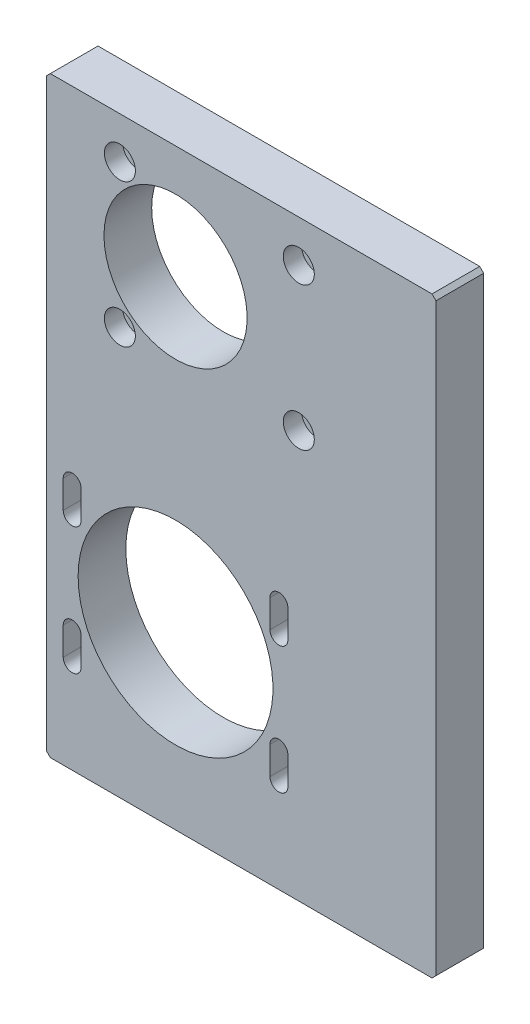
ISO-10303-21;
HEADER;
FILE_DESCRIPTION(('STEP AP214'),'2;1');
FILE_NAME('part.step','',(''),(''),'','','');
FILE_SCHEMA(('AUTOMOTIVE_DESIGN { 1 0 10303 214 1 1 1 1 }'));
ENDSEC;
DATA;
#1=APPLICATION_CONTEXT('core data for automotive mechanical design processes');
#2=APPLICATION_PROTOCOL_DEFINITION('international standard','automotive_design',2000,#1);
#3=PRODUCT_CONTEXT('',#1,'mechanical');
#4=PRODUCT('Part','Part','',(#3));
#5=PRODUCT_RELATED_PRODUCT_CATEGORY('part','',(#4));
#6=PRODUCT_DEFINITION_FORMATION('','',#4);
#7=PRODUCT_DEFINITION_CONTEXT('part definition',#1,'design');
#8=PRODUCT_DEFINITION('design','',#6,#7);
#9=PRODUCT_DEFINITION_SHAPE('','',#8);
#10=(LENGTH_UNIT() NAMED_UNIT(*) SI_UNIT(.MILLI.,.METRE.));
#11=(NAMED_UNIT(*) PLANE_ANGLE_UNIT() SI_UNIT($,.RADIAN.));
#12=(NAMED_UNIT(*) SI_UNIT($,.STERADIAN.) SOLID_ANGLE_UNIT());
#13=UNCERTAINTY_MEASURE_WITH_UNIT(LENGTH_MEASURE(1.E-05),#10,'distance_accuracy_value','');
#14=(GEOMETRIC_REPRESENTATION_CONTEXT(3) GLOBAL_UNCERTAINTY_ASSIGNED_CONTEXT((#13)) GLOBAL_UNIT_ASSIGNED_CONTEXT((#10,
#11,#12)) REPRESENTATION_CONTEXT('',''));
#15=CARTESIAN_POINT('',(0.,0.,0.));
#16=DIRECTION('',(0.,0.,1.));
#17=DIRECTION('',(1.,0.,0.));
#18=AXIS2_PLACEMENT_3D('',#15,#16,#17);
#19=CARTESIAN_POINT('',(13299.82505141,2105.954083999,0.));
#20=DIRECTION('',(0.,0.,1.));
#21=DIRECTION('',(1.,0.,0.));
#22=AXIS2_PLACEMENT_3D('',#19,#20,#21);
#23=CYLINDRICAL_SURFACE('',#22,2.25000000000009);
#24=CARTESIAN_POINT('',(13299.82505141,2105.954083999,0.));
#25=DIRECTION('',(0.,0.,1.));
#26=DIRECTION('',(1.,0.,0.));
#27=AXIS2_PLACEMENT_3D('',#24,#25,#26);
#28=CIRCLE('',#27,2.25000000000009);
#29=CARTESIAN_POINT('',(13302.07505141,2105.954083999,0.));
#30=VERTEX_POINT('',#29);
#31=EDGE_CURVE('E314',#30,#30,#28,.F.);
#32=ORIENTED_EDGE('',*,*,#31,.T.);
#33=EDGE_LOOP('',(#32));
#34=FACE_BOUND('',#33,.T.);
#35=CARTESIAN_POINT('',(13299.82505141,2105.954083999,7.4));
#36=DIRECTION('',(0.,0.,1.));
#37=DIRECTION('',(1.,0.,0.));
#38=AXIS2_PLACEMENT_3D('',#35,#36,#37);
#39=CIRCLE('',#38,2.25000000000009);
#40=CARTESIAN_POINT('',(13302.07505141,2105.954083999,7.4));
#41=VERTEX_POINT('',#40);
#42=EDGE_CURVE('E21',#41,#41,#39,.T.);
#43=ORIENTED_EDGE('',*,*,#42,.T.);
#44=EDGE_LOOP('',(#43));
#45=FACE_BOUND('',#44,.T.);
#46=ADVANCED_FACE('F17',(#34,#45),#23,.F.);
#47=CARTESIAN_POINT('',(13254.82505141,2105.954083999,0.));
#48=DIRECTION('',(0.,0.,1.));
#49=DIRECTION('',(1.,0.,0.));
#50=AXIS2_PLACEMENT_3D('',#47,#48,#49);
#51=CYLINDRICAL_SURFACE('',#50,2.25000000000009);
#52=CARTESIAN_POINT('',(13254.82505141,2105.954083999,0.));
#53=DIRECTION('',(0.,0.,1.));
#54=DIRECTION('',(1.,0.,0.));
#55=AXIS2_PLACEMENT_3D('',#52,#53,#54);
#56=CIRCLE('',#55,2.25000000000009);
#57=CARTESIAN_POINT('',(13257.07505141,2105.954083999,0.));
#58=VERTEX_POINT('',#57);
#59=EDGE_CURVE('E311',#58,#58,#56,.F.);
#60=ORIENTED_EDGE('',*,*,#59,.T.);
#61=EDGE_LOOP('',(#60));
#62=FACE_BOUND('',#61,.T.);
#63=CARTESIAN_POINT('',(13254.82505141,2105.954083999,7.4));
#64=DIRECTION('',(0.,0.,1.));
#65=DIRECTION('',(1.,0.,0.));
#66=AXIS2_PLACEMENT_3D('',#63,#64,#65);
#67=CIRCLE('',#66,2.25000000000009);
#68=CARTESIAN_POINT('',(13257.07505141,2105.954083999,7.4));
#69=VERTEX_POINT('',#68);
#70=EDGE_CURVE('E325',#69,#69,#67,.T.);
#71=ORIENTED_EDGE('',*,*,#70,.T.);
#72=EDGE_LOOP('',(#71));
#73=FACE_BOUND('',#72,.T.);
#74=ADVANCED_FACE('F545',(#62,#73),#51,.F.);
#75=CARTESIAN_POINT('',(13254.82505141,2141.954083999,0.));
#76=DIRECTION('',(0.,0.,1.));
#77=DIRECTION('',(1.,0.,0.));
#78=AXIS2_PLACEMENT_3D('',#75,#76,#77);
#79=CYLINDRICAL_SURFACE('',#78,2.25000000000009);
#80=CARTESIAN_POINT('',(13254.82505141,2141.954083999,0.));
#81=DIRECTION('',(0.,0.,1.));
#82=DIRECTION('',(1.,0.,0.));
#83=AXIS2_PLACEMENT_3D('',#80,#81,#82);
#84=CIRCLE('',#83,2.25000000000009);
#85=CARTESIAN_POINT('',(13257.07505141,2141.954083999,0.));
#86=VERTEX_POINT('',#85);
#87=EDGE_CURVE('E308',#86,#86,#84,.F.);
#88=ORIENTED_EDGE('',*,*,#87,.T.);
#89=EDGE_LOOP('',(#88));
#90=FACE_BOUND('',#89,.T.);
#91=CARTESIAN_POINT('',(13254.82505141,2141.954083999,7.4));
#92=DIRECTION('',(0.,0.,1.));
#93=DIRECTION('',(1.,0.,0.));
#94=AXIS2_PLACEMENT_3D('',#91,#92,#93);
#95=CIRCLE('',#94,2.25000000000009);
#96=CARTESIAN_POINT('',(13257.07505141,2141.954083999,7.4));
#97=VERTEX_POINT('',#96);
#98=EDGE_CURVE('E183',#97,#97,#95,.T.);
#99=ORIENTED_EDGE('',*,*,#98,.T.);
#100=EDGE_LOOP('',(#99));
#101=FACE_BOUND('',#100,.T.);
#102=ADVANCED_FACE('F542',(#90,#101),#79,.F.);
#103=CARTESIAN_POINT('',(13237.32505141,2003.454083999,0.));
#104=DIRECTION('',(0.707106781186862,0.707106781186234,0.));
#105=DIRECTION('',(-0.707106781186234,0.707106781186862,0.));
#106=AXIS2_PLACEMENT_3D('',#103,#104,#105);
#107=PLANE('',#106);
#108=DIRECTION('',(0.,0.,1.));
#109=VECTOR('',#108,1.);
#110=CARTESIAN_POINT('',(13237.32505141,2003.454083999,6.));
#111=LINE('',#110,#109);
#112=CARTESIAN_POINT('',(13237.32505141,2003.454083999,0.));
#113=VERTEX_POINT('',#112);
#114=CARTESIAN_POINT('',(13237.325051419,2003.454083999,12.));
#115=VERTEX_POINT('',#114);
#116=EDGE_CURVE('E165',#113,#115,#111,.T.);
#117=ORIENTED_EDGE('',*,*,#116,.T.);
#118=DIRECTION('',(0.707106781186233,-0.707106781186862,0.));
#119=VECTOR('',#118,1.);
#120=CARTESIAN_POINT('',(13236.82505141,2003.954083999,12.));
#121=LINE('',#120,#119);
#122=CARTESIAN_POINT('',(13236.32505141,2004.45408398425,12.));
#123=VERTEX_POINT('',#122);
#124=EDGE_CURVE('E348',#123,#115,#121,.T.);
#125=ORIENTED_EDGE('',*,*,#124,.F.);
#126=DIRECTION('',(0.,0.,-1.));
#127=VECTOR('',#126,1.);
#128=CARTESIAN_POINT('',(13236.32505141,2004.454083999,6.));
#129=LINE('',#128,#127);
#130=CARTESIAN_POINT('',(13236.32505141,2004.454083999,0.));
#131=VERTEX_POINT('',#130);
#132=EDGE_CURVE('E181',#123,#131,#129,.T.);
#133=ORIENTED_EDGE('',*,*,#132,.T.);
#134=DIRECTION('',(-0.707106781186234,0.707106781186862,0.));
#135=VECTOR('',#134,1.);
#136=CARTESIAN_POINT('',(13237.32505141,2003.454083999,0.));
#137=LINE('',#136,#135);
#138=EDGE_CURVE('E158',#131,#113,#137,.F.);
#139=ORIENTED_EDGE('',*,*,#138,.T.);
#140=EDGE_LOOP('',(#117,#125,#133,#139));
#141=FACE_BOUND('',#140,.T.);
#142=ADVANCED_FACE('F179',(#141),#107,.F.);
#143=CARTESIAN_POINT('',(13334.32505141,2004.454083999,0.));
#144=DIRECTION('',(-0.707106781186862,0.707106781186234,0.));
#145=DIRECTION('',(-0.707106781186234,-0.707106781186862,0.));
#146=AXIS2_PLACEMENT_3D('',#143,#144,#145);
#147=PLANE('',#146);
#148=DIRECTION('',(0.,0.,1.));
#149=VECTOR('',#148,1.);
#150=CARTESIAN_POINT('',(13334.32505141,2004.454083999,6.));
#151=LINE('',#150,#149);
#152=CARTESIAN_POINT('',(13334.32505141,2004.454083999,0.));
#153=VERTEX_POINT('',#152);
#154=CARTESIAN_POINT('',(13334.32505141,2004.45408398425,12.));
#155=VERTEX_POINT('',#154);
#156=EDGE_CURVE('E189',#153,#155,#151,.T.);
#157=ORIENTED_EDGE('',*,*,#156,.T.);
#158=DIRECTION('',(0.707106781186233,0.707106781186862,0.));
#159=VECTOR('',#158,1.);
#160=CARTESIAN_POINT('',(13333.82505141,2003.954083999,12.));
#161=LINE('',#160,#159);
#162=CARTESIAN_POINT('',(13333.325051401,2003.454083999,12.));
#163=VERTEX_POINT('',#162);
#164=EDGE_CURVE('E341',#163,#155,#161,.T.);
#165=ORIENTED_EDGE('',*,*,#164,.F.);
#166=DIRECTION('',(0.,0.,-1.));
#167=VECTOR('',#166,1.);
#168=CARTESIAN_POINT('',(13333.32505141,2003.454083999,6.));
#169=LINE('',#168,#167);
#170=CARTESIAN_POINT('',(13333.32505141,2003.454083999,0.));
#171=VERTEX_POINT('',#170);
#172=EDGE_CURVE('E175',#163,#171,#169,.T.);
#173=ORIENTED_EDGE('',*,*,#172,.T.);
#174=DIRECTION('',(-0.707106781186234,-0.707106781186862,0.));
#175=VECTOR('',#174,1.);
#176=CARTESIAN_POINT('',(13334.32505141,2004.454083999,0.));
#177=LINE('',#176,#175);
#178=EDGE_CURVE('E182',#171,#153,#177,.F.);
#179=ORIENTED_EDGE('',*,*,#178,.T.);
#180=EDGE_LOOP('',(#157,#165,#173,#179));
#181=FACE_BOUND('',#180,.T.);
#182=ADVANCED_FACE('F555',(#181),#147,.F.);
#183=CARTESIAN_POINT('',(13333.32505141,2152.454083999,0.));
#184=DIRECTION('',(-0.707106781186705,-0.707106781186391,0.));
#185=DIRECTION('',(0.707106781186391,-0.707106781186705,0.));
#186=AXIS2_PLACEMENT_3D('',#183,#184,#185);
#187=PLANE('',#186);
#188=DIRECTION('',(0.,0.,1.));
#189=VECTOR('',#188,1.);
#190=CARTESIAN_POINT('',(13333.32505141,2152.454083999,6.));
#191=LINE('',#190,#189);
#192=CARTESIAN_POINT('',(13333.32505141,2152.454083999,0.));
#193=VERTEX_POINT('',#192);
#194=CARTESIAN_POINT('',(13333.325051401,2152.454083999,12.));
#195=VERTEX_POINT('',#194);
#196=EDGE_CURVE('E205',#193,#195,#191,.T.);
#197=ORIENTED_EDGE('',*,*,#196,.T.);
#198=DIRECTION('',(-0.707106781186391,0.707106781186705,0.));
#199=VECTOR('',#198,1.);
#200=CARTESIAN_POINT('',(13333.82505141,2151.954083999,12.));
#201=LINE('',#200,#199);
#202=CARTESIAN_POINT('',(13334.32505141,2151.45408401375,12.));
#203=VERTEX_POINT('',#202);
#204=EDGE_CURVE('E334',#203,#195,#201,.T.);
#205=ORIENTED_EDGE('',*,*,#204,.F.);
#206=DIRECTION('',(0.,0.,-1.));
#207=VECTOR('',#206,1.);
#208=CARTESIAN_POINT('',(13334.32505141,2151.454083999,6.));
#209=LINE('',#208,#207);
#210=CARTESIAN_POINT('',(13334.32505141,2151.454083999,0.));
#211=VERTEX_POINT('',#210);
#212=EDGE_CURVE('E192',#203,#211,#209,.T.);
#213=ORIENTED_EDGE('',*,*,#212,.T.);
#214=DIRECTION('',(0.707106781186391,-0.707106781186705,0.));
#215=VECTOR('',#214,1.);
#216=CARTESIAN_POINT('',(13333.32505141,2152.454083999,0.));
#217=LINE('',#216,#215);
#218=EDGE_CURVE('E320',#211,#193,#217,.F.);
#219=ORIENTED_EDGE('',*,*,#218,.T.);
#220=EDGE_LOOP('',(#197,#205,#213,#219));
#221=FACE_BOUND('',#220,.T.);
#222=ADVANCED_FACE('F358',(#221),#187,.F.);
#223=CARTESIAN_POINT('',(13236.32505141,2151.454083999,0.));
#224=DIRECTION('',(0.707106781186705,-0.707106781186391,0.));
#225=DIRECTION('',(0.707106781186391,0.707106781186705,0.));
#226=AXIS2_PLACEMENT_3D('',#223,#224,#225);
#227=PLANE('',#226);
#228=DIRECTION('',(0.,0.,1.));
#229=VECTOR('',#228,1.);
#230=CARTESIAN_POINT('',(13236.32505141,2151.454083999,6.));
#231=LINE('',#230,#229);
#232=CARTESIAN_POINT('',(13236.32505141,2151.454083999,0.));
#233=VERTEX_POINT('',#232);
#234=CARTESIAN_POINT('',(13236.32505141,2151.45408401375,12.));
#235=VERTEX_POINT('',#234);
#236=EDGE_CURVE('E200',#233,#235,#231,.T.);
#237=ORIENTED_EDGE('',*,*,#236,.T.);
#238=DIRECTION('',(-0.707106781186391,-0.707106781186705,0.));
#239=VECTOR('',#238,1.);
#240=CARTESIAN_POINT('',(13236.82505141,2151.954083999,12.));
#241=LINE('',#240,#239);
#242=CARTESIAN_POINT('',(13237.325051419,2152.454083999,12.));
#243=VERTEX_POINT('',#242);
#244=EDGE_CURVE('E330',#243,#235,#241,.T.);
#245=ORIENTED_EDGE('',*,*,#244,.F.);
#246=DIRECTION('',(0.,0.,-1.));
#247=VECTOR('',#246,1.);
#248=CARTESIAN_POINT('',(13237.32505141,2152.454083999,6.));
#249=LINE('',#248,#247);
#250=CARTESIAN_POINT('',(13237.32505141,2152.454083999,0.));
#251=VERTEX_POINT('',#250);
#252=EDGE_CURVE('E202',#243,#251,#249,.T.);
#253=ORIENTED_EDGE('',*,*,#252,.T.);
#254=DIRECTION('',(0.707106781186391,0.707106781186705,0.));
#255=VECTOR('',#254,1.);
#256=CARTESIAN_POINT('',(13236.32505141,2151.454083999,0.));
#257=LINE('',#256,#255);
#258=EDGE_CURVE('E317',#251,#233,#257,.F.);
#259=ORIENTED_EDGE('',*,*,#258,.T.);
#260=EDGE_LOOP('',(#237,#245,#253,#259));
#261=FACE_BOUND('',#260,.T.);
#262=ADVANCED_FACE('F561',(#261),#227,.F.);
#263=CARTESIAN_POINT('',(13303.77185141,2102.007283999,7.4));
#264=DIRECTION('',(0.,0.,-1.));
#265=DIRECTION('',(-1.,0.,0.));
#266=AXIS2_PLACEMENT_3D('',#263,#264,#265);
#267=PLANE('',#266);
#268=ORIENTED_EDGE('',*,*,#42,.F.);
#269=EDGE_LOOP('',(#268));
#270=FACE_BOUND('',#269,.T.);
#271=CARTESIAN_POINT('',(13299.82505141,2105.954083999,7.4));
#272=DIRECTION('',(0.,0.,1.));
#273=DIRECTION('',(0.,-1.,0.));
#274=AXIS2_PLACEMENT_3D('',#271,#272,#273);
#275=CIRCLE('',#274,3.90000000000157);
#276=CARTESIAN_POINT('',(13299.82505141,2102.054083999,7.4));
#277=VERTEX_POINT('',#276);
#278=EDGE_CURVE('E303',#277,#277,#275,.F.);
#279=ORIENTED_EDGE('',*,*,#278,.F.);
#280=EDGE_LOOP('',(#279));
#281=FACE_BOUND('',#280,.T.);
#282=ADVANCED_FACE('F564',(#270,#281),#267,.F.);
#283=CARTESIAN_POINT('',(13258.77185141,2102.007283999,7.4));
#284=DIRECTION('',(0.,0.,-1.));
#285=DIRECTION('',(-1.,0.,0.));
#286=AXIS2_PLACEMENT_3D('',#283,#284,#285);
#287=PLANE('',#286);
#288=ORIENTED_EDGE('',*,*,#70,.F.);
#289=EDGE_LOOP('',(#288));
#290=FACE_BOUND('',#289,.T.);
#291=CARTESIAN_POINT('',(13254.82505141,2105.954083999,7.4));
#292=DIRECTION('',(0.,0.,1.));
#293=DIRECTION('',(0.,-1.,0.));
#294=AXIS2_PLACEMENT_3D('',#291,#292,#293);
#295=CIRCLE('',#294,3.90000000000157);
#296=CARTESIAN_POINT('',(13254.82505141,2102.054083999,7.4));
#297=VERTEX_POINT('',#296);
#298=EDGE_CURVE('E300',#297,#297,#295,.F.);
#299=ORIENTED_EDGE('',*,*,#298,.F.);
#300=EDGE_LOOP('',(#299));
#301=FACE_BOUND('',#300,.T.);
#302=ADVANCED_FACE('F480',(#290,#301),#287,.F.);
#303=CARTESIAN_POINT('',(13258.77185141,2138.007283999,7.4));
#304=DIRECTION('',(0.,0.,-1.));
#305=DIRECTION('',(-1.,0.,0.));
#306=AXIS2_PLACEMENT_3D('',#303,#304,#305);
#307=PLANE('',#306);
#308=ORIENTED_EDGE('',*,*,#98,.F.);
#309=EDGE_LOOP('',(#308));
#310=FACE_BOUND('',#309,.T.);
#311=CARTESIAN_POINT('',(13254.82505141,2141.954083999,7.4));
#312=DIRECTION('',(0.,0.,1.));
#313=DIRECTION('',(0.,-1.,0.));
#314=AXIS2_PLACEMENT_3D('',#311,#312,#313);
#315=CIRCLE('',#314,3.90000000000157);
#316=CARTESIAN_POINT('',(13254.82505141,2138.054083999,7.4));
#317=VERTEX_POINT('',#316);
#318=EDGE_CURVE('E297',#317,#317,#315,.F.);
#319=ORIENTED_EDGE('',*,*,#318,.F.);
#320=EDGE_LOOP('',(#319));
#321=FACE_BOUND('',#320,.T.);
#322=ADVANCED_FACE('F470',(#310,#321),#307,.F.);
#323=CARTESIAN_POINT('',(13236.32505141,2003.454083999,0.));
#324=DIRECTION('',(0.,0.,1.));
#325=DIRECTION('',(1.,0.,0.));
#326=AXIS2_PLACEMENT_3D('',#323,#324,#325);
#327=PLANE('',#326);
#328=DIRECTION('',(0.,-1.,0.));
#329=VECTOR('',#328,1.);
#330=CARTESIAN_POINT('',(13240.57505141,2030.454083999,0.));
#331=LINE('',#330,#329);
#332=CARTESIAN_POINT('',(13240.57505141,2033.954083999,0.));
#333=VERTEX_POINT('',#332);
#334=CARTESIAN_POINT('',(13240.57505141,2026.9540839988,0.));
#335=VERTEX_POINT('',#334);
#336=EDGE_CURVE('E265',#333,#335,#331,.T.);
#337=ORIENTED_EDGE('',*,*,#336,.T.);
#338=CARTESIAN_POINT('',(13242.82505141,2026.954083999,0.));
#339=DIRECTION('',(0.,0.,-1.));
#340=DIRECTION('',(-1.,0.,0.));
#341=AXIS2_PLACEMENT_3D('',#338,#339,#340);
#342=CIRCLE('',#341,2.25000000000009);
#343=CARTESIAN_POINT('',(13245.07505141,2026.95408399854,0.));
#344=VERTEX_POINT('',#343);
#345=EDGE_CURVE('E258',#344,#335,#342,.T.);
#346=ORIENTED_EDGE('',*,*,#345,.F.);
#347=DIRECTION('',(0.,1.,0.));
#348=VECTOR('',#347,1.);
#349=CARTESIAN_POINT('',(13245.07505141,2030.454083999,0.));
#350=LINE('',#349,#348);
#351=CARTESIAN_POINT('',(13245.07505141,2033.954083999,0.));
#352=VERTEX_POINT('',#351);
#353=EDGE_CURVE('E261',#344,#352,#350,.T.);
#354=ORIENTED_EDGE('',*,*,#353,.T.);
#355=CARTESIAN_POINT('',(13242.82505141,2033.954083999,0.));
#356=DIRECTION('',(0.,0.,-1.));
#357=DIRECTION('',(-1.,0.,0.));
#358=AXIS2_PLACEMENT_3D('',#355,#356,#357);
#359=CIRCLE('',#358,2.25000000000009);
#360=EDGE_CURVE('E262',#333,#352,#359,.T.);
#361=ORIENTED_EDGE('',*,*,#360,.F.);
#362=EDGE_LOOP('',(#337,#346,#354,#361));
#363=FACE_BOUND('',#362,.T.);
#364=DIRECTION('',(0.,-1.,0.));
#365=VECTOR('',#364,1.);
#366=CARTESIAN_POINT('',(13240.57505141,2062.454083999,0.));
#367=LINE('',#366,#365);
#368=CARTESIAN_POINT('',(13240.57505141,2065.954083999,0.));
#369=VERTEX_POINT('',#368);
#370=CARTESIAN_POINT('',(13240.57505141,2058.9540839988,0.));
#371=VERTEX_POINT('',#370);
#372=EDGE_CURVE('E293',#369,#371,#367,.T.);
#373=ORIENTED_EDGE('',*,*,#372,.T.);
#374=CARTESIAN_POINT('',(13242.82505141,2058.954083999,0.));
#375=DIRECTION('',(0.,0.,-1.));
#376=DIRECTION('',(-1.,0.,0.));
#377=AXIS2_PLACEMENT_3D('',#374,#375,#376);
#378=CIRCLE('',#377,2.25000000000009);
#379=CARTESIAN_POINT('',(13245.07505141,2058.95408399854,0.));
#380=VERTEX_POINT('',#379);
#381=EDGE_CURVE('E286',#380,#371,#378,.T.);
#382=ORIENTED_EDGE('',*,*,#381,.F.);
#383=DIRECTION('',(0.,1.,0.));
#384=VECTOR('',#383,1.);
#385=CARTESIAN_POINT('',(13245.07505141,2062.454083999,0.));
#386=LINE('',#385,#384);
#387=CARTESIAN_POINT('',(13245.07505141,2065.954083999,0.));
#388=VERTEX_POINT('',#387);
#389=EDGE_CURVE('E289',#380,#388,#386,.T.);
#390=ORIENTED_EDGE('',*,*,#389,.T.);
#391=CARTESIAN_POINT('',(13242.82505141,2065.954083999,0.));
#392=DIRECTION('',(0.,0.,-1.));
#393=DIRECTION('',(-1.,0.,0.));
#394=AXIS2_PLACEMENT_3D('',#391,#392,#393);
#395=CIRCLE('',#394,2.25000000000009);
#396=EDGE_CURVE('E290',#369,#388,#395,.T.);
#397=ORIENTED_EDGE('',*,*,#396,.F.);
#398=EDGE_LOOP('',(#373,#382,#390,#397));
#399=FACE_BOUND('',#398,.T.);
#400=DIRECTION('',(0.,-1.,0.));
#401=VECTOR('',#400,1.);
#402=CARTESIAN_POINT('',(13292.57505141,2062.454083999,0.));
#403=LINE('',#402,#401);
#404=CARTESIAN_POINT('',(13292.57505141,2065.954083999,0.));
#405=VERTEX_POINT('',#404);
#406=CARTESIAN_POINT('',(13292.57505141,2058.9540839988,0.));
#407=VERTEX_POINT('',#406);
#408=EDGE_CURVE('E273',#405,#407,#403,.T.);
#409=ORIENTED_EDGE('',*,*,#408,.T.);
#410=CARTESIAN_POINT('',(13294.82505141,2058.954083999,0.));
#411=DIRECTION('',(0.,0.,-1.));
#412=DIRECTION('',(-1.,0.,0.));
#413=AXIS2_PLACEMENT_3D('',#410,#411,#412);
#414=CIRCLE('',#413,2.25000000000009);
#415=CARTESIAN_POINT('',(13297.07505141,2058.95408399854,0.));
#416=VERTEX_POINT('',#415);
#417=EDGE_CURVE('E266',#416,#407,#414,.T.);
#418=ORIENTED_EDGE('',*,*,#417,.F.);
#419=DIRECTION('',(0.,1.,0.));
#420=VECTOR('',#419,1.);
#421=CARTESIAN_POINT('',(13297.07505141,2062.454083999,0.));
#422=LINE('',#421,#420);
#423=CARTESIAN_POINT('',(13297.07505141,2065.954083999,0.));
#424=VERTEX_POINT('',#423);
#425=EDGE_CURVE('E269',#416,#424,#422,.T.);
#426=ORIENTED_EDGE('',*,*,#425,.T.);
#427=CARTESIAN_POINT('',(13294.82505141,2065.954083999,0.));
#428=DIRECTION('',(0.,0.,-1.));
#429=DIRECTION('',(-1.,0.,0.));
#430=AXIS2_PLACEMENT_3D('',#427,#428,#429);
#431=CIRCLE('',#430,2.25000000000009);
#432=EDGE_CURVE('E270',#405,#424,#431,.T.);
#433=ORIENTED_EDGE('',*,*,#432,.F.);
#434=EDGE_LOOP('',(#409,#418,#426,#433));
#435=FACE_BOUND('',#434,.T.);
#436=DIRECTION('',(0.,-1.,0.));
#437=VECTOR('',#436,1.);
#438=CARTESIAN_POINT('',(13292.57505141,2030.454083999,0.));
#439=LINE('',#438,#437);
#440=CARTESIAN_POINT('',(13292.57505141,2033.954083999,0.));
#441=VERTEX_POINT('',#440);
#442=CARTESIAN_POINT('',(13292.57505141,2026.9540839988,0.));
#443=VERTEX_POINT('',#442);
#444=EDGE_CURVE('E285',#441,#443,#439,.T.);
#445=ORIENTED_EDGE('',*,*,#444,.T.);
#446=CARTESIAN_POINT('',(13294.82505141,2026.954083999,0.));
#447=DIRECTION('',(0.,0.,-1.));
#448=DIRECTION('',(-1.,0.,0.));
#449=AXIS2_PLACEMENT_3D('',#446,#447,#448);
#450=CIRCLE('',#449,2.25000000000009);
#451=CARTESIAN_POINT('',(13297.07505141,2026.95408399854,0.));
#452=VERTEX_POINT('',#451);
#453=EDGE_CURVE('E278',#452,#443,#450,.T.);
#454=ORIENTED_EDGE('',*,*,#453,.F.);
#455=DIRECTION('',(0.,1.,0.));
#456=VECTOR('',#455,1.);
#457=CARTESIAN_POINT('',(13297.07505141,2030.454083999,0.));
#458=LINE('',#457,#456);
#459=CARTESIAN_POINT('',(13297.07505141,2033.954083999,0.));
#460=VERTEX_POINT('',#459);
#461=EDGE_CURVE('E281',#452,#460,#458,.T.);
#462=ORIENTED_EDGE('',*,*,#461,.T.);
#463=CARTESIAN_POINT('',(13294.82505141,2033.954083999,0.));
#464=DIRECTION('',(0.,0.,-1.));
#465=DIRECTION('',(-1.,0.,0.));
#466=AXIS2_PLACEMENT_3D('',#463,#464,#465);
#467=CIRCLE('',#466,2.25000000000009);
#468=EDGE_CURVE('E282',#441,#460,#467,.T.);
#469=ORIENTED_EDGE('',*,*,#468,.F.);
#470=EDGE_LOOP('',(#445,#454,#462,#469));
#471=FACE_BOUND('',#470,.T.);
#472=CARTESIAN_POINT('',(13268.82505141,2046.454083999,0.));
#473=DIRECTION('',(0.,0.,-1.));
#474=DIRECTION('',(-1.,0.,0.));
#475=AXIS2_PLACEMENT_3D('',#472,#473,#474);
#476=CIRCLE('',#475,24.4999999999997);
#477=CARTESIAN_POINT('',(13244.32505141,2046.454083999,0.));
#478=VERTEX_POINT('',#477);
#479=EDGE_CURVE('E274',#478,#478,#476,.T.);
#480=ORIENTED_EDGE('',*,*,#479,.F.);
#481=EDGE_LOOP('',(#480));
#482=FACE_BOUND('',#481,.T.);
#483=CARTESIAN_POINT('',(13268.82505141,2123.954083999,0.));
#484=DIRECTION('',(0.,0.,-1.));
#485=DIRECTION('',(-1.,0.,0.));
#486=AXIS2_PLACEMENT_3D('',#483,#484,#485);
#487=CIRCLE('',#486,17.9999999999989);
#488=CARTESIAN_POINT('',(13250.82505141,2123.954083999,0.));
#489=VERTEX_POINT('',#488);
#490=EDGE_CURVE('E294',#489,#489,#487,.T.);
#491=ORIENTED_EDGE('',*,*,#490,.F.);
#492=EDGE_LOOP('',(#491));
#493=FACE_BOUND('',#492,.T.);
#494=ORIENTED_EDGE('',*,*,#87,.F.);
#495=EDGE_LOOP('',(#494));
#496=FACE_BOUND('',#495,.T.);
#497=ORIENTED_EDGE('',*,*,#59,.F.);
#498=EDGE_LOOP('',(#497));
#499=FACE_BOUND('',#498,.T.);
#500=ORIENTED_EDGE('',*,*,#31,.F.);
#501=EDGE_LOOP('',(#500));
#502=FACE_BOUND('',#501,.T.);
#503=CARTESIAN_POINT('',(13299.82505141,2141.954083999,0.));
#504=DIRECTION('',(0.,0.,1.));
#505=DIRECTION('',(1.,0.,0.));
#506=AXIS2_PLACEMENT_3D('',#503,#504,#505);
#507=CIRCLE('',#506,2.25000000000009);
#508=CARTESIAN_POINT('',(13302.07505141,2141.954083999,0.));
#509=VERTEX_POINT('',#508);
#510=EDGE_CURVE('E207',#509,#509,#507,.F.);
#511=ORIENTED_EDGE('',*,*,#510,.F.);
#512=EDGE_LOOP('',(#511));
#513=FACE_BOUND('',#512,.T.);
#514=DIRECTION('',(1.,0.,0.));
#515=VECTOR('',#514,1.);
#516=CARTESIAN_POINT('',(13285.32505141,2152.454083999,0.));
#517=LINE('',#516,#515);
#518=EDGE_CURVE('E196',#251,#193,#517,.T.);
#519=ORIENTED_EDGE('',*,*,#518,.T.);
#520=ORIENTED_EDGE('',*,*,#218,.F.);
#521=DIRECTION('',(0.,-1.,0.));
#522=VECTOR('',#521,1.);
#523=CARTESIAN_POINT('',(13334.32505141,2077.954083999,0.));
#524=LINE('',#523,#522);
#525=EDGE_CURVE('E351',#211,#153,#524,.T.);
#526=ORIENTED_EDGE('',*,*,#525,.T.);
#527=ORIENTED_EDGE('',*,*,#178,.F.);
#528=DIRECTION('',(-1.,0.,0.));
#529=VECTOR('',#528,1.);
#530=CARTESIAN_POINT('',(13285.32505141,2003.454083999,0.));
#531=LINE('',#530,#529);
#532=EDGE_CURVE('E168',#171,#113,#531,.T.);
#533=ORIENTED_EDGE('',*,*,#532,.T.);
#534=ORIENTED_EDGE('',*,*,#138,.F.);
#535=DIRECTION('',(0.,1.,0.));
#536=VECTOR('',#535,1.);
#537=CARTESIAN_POINT('',(13236.32505141,2077.954083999,0.));
#538=LINE('',#537,#536);
#539=EDGE_CURVE('E176',#131,#233,#538,.T.);
#540=ORIENTED_EDGE('',*,*,#539,.T.);
#541=ORIENTED_EDGE('',*,*,#258,.F.);
#542=EDGE_LOOP('',(#519,#520,#526,#527,#533,#534,#540,#541));
#543=FACE_BOUND('',#542,.T.);
#544=ADVANCED_FACE('F186',(#363,#399,#435,#471,#482,#493,#496,#499,#502,#513,#543),#327,.F.);
#545=CARTESIAN_POINT('',(13299.82505141,2141.954083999,0.));
#546=DIRECTION('',(0.,0.,1.));
#547=DIRECTION('',(1.,0.,0.));
#548=AXIS2_PLACEMENT_3D('',#545,#546,#547);
#549=CYLINDRICAL_SURFACE('',#548,2.25000000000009);
#550=ORIENTED_EDGE('',*,*,#510,.T.);
#551=EDGE_LOOP('',(#550));
#552=FACE_BOUND('',#551,.T.);
#553=CARTESIAN_POINT('',(13299.82505141,2141.954083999,7.4));
#554=DIRECTION('',(0.,0.,1.));
#555=DIRECTION('',(1.,0.,0.));
#556=AXIS2_PLACEMENT_3D('',#553,#554,#555);
#557=CIRCLE('',#556,2.25000000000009);
#558=CARTESIAN_POINT('',(13302.07505141,2141.954083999,7.4));
#559=VERTEX_POINT('',#558);
#560=EDGE_CURVE('E253',#559,#559,#557,.T.);
#561=ORIENTED_EDGE('',*,*,#560,.T.);
#562=EDGE_LOOP('',(#561));
#563=FACE_BOUND('',#562,.T.);
#564=ADVANCED_FACE('F469',(#552,#563),#549,.F.);
#565=CARTESIAN_POINT('',(13236.32505141,2004.454083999,12.));
#566=DIRECTION('',(1.,0.,0.));
#567=DIRECTION('',(0.,0.,-1.));
#568=AXIS2_PLACEMENT_3D('',#565,#566,#567);
#569=PLANE('',#568);
#570=ORIENTED_EDGE('',*,*,#132,.F.);
#571=DIRECTION('',(0.,-1.,0.));
#572=VECTOR('',#571,1.);
#573=CARTESIAN_POINT('',(13236.32505141,2077.954083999,12.));
#574=LINE('',#573,#572);
#575=EDGE_CURVE('E256',#235,#123,#574,.T.);
#576=ORIENTED_EDGE('',*,*,#575,.F.);
#577=ORIENTED_EDGE('',*,*,#236,.F.);
#578=ORIENTED_EDGE('',*,*,#539,.F.);
#579=EDGE_LOOP('',(#570,#576,#577,#578));
#580=FACE_BOUND('',#579,.T.);
#581=ADVANCED_FACE('F477',(#580),#569,.F.);
#582=CARTESIAN_POINT('',(13237.32505141,2003.454083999,0.));
#583=DIRECTION('',(0.,1.,0.));
#584=DIRECTION('',(0.,0.,1.));
#585=AXIS2_PLACEMENT_3D('',#582,#583,#584);
#586=PLANE('',#585);
#587=ORIENTED_EDGE('',*,*,#172,.F.);
#588=DIRECTION('',(1.,0.,0.));
#589=VECTOR('',#588,1.);
#590=CARTESIAN_POINT('',(13285.32505141,2003.454083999,12.));
#591=LINE('',#590,#589);
#592=EDGE_CURVE('E172',#115,#163,#591,.T.);
#593=ORIENTED_EDGE('',*,*,#592,.F.);
#594=ORIENTED_EDGE('',*,*,#116,.F.);
#595=ORIENTED_EDGE('',*,*,#532,.F.);
#596=EDGE_LOOP('',(#587,#593,#594,#595));
#597=FACE_BOUND('',#596,.T.);
#598=ADVANCED_FACE('F167',(#597),#586,.F.);
#599=CARTESIAN_POINT('',(13334.32505141,2004.454083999,0.));
#600=DIRECTION('',(-1.,0.,0.));
#601=DIRECTION('',(0.,0.,1.));
#602=AXIS2_PLACEMENT_3D('',#599,#600,#601);
#603=PLANE('',#602);
#604=ORIENTED_EDGE('',*,*,#212,.F.);
#605=DIRECTION('',(0.,1.,0.));
#606=VECTOR('',#605,1.);
#607=CARTESIAN_POINT('',(13334.32505141,2077.954083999,12.));
#608=LINE('',#607,#606);
#609=EDGE_CURVE('E366',#155,#203,#608,.T.);
#610=ORIENTED_EDGE('',*,*,#609,.F.);
#611=ORIENTED_EDGE('',*,*,#156,.F.);
#612=ORIENTED_EDGE('',*,*,#525,.F.);
#613=EDGE_LOOP('',(#604,#610,#611,#612));
#614=FACE_BOUND('',#613,.T.);
#615=ADVANCED_FACE('F614',(#614),#603,.F.);
#616=CARTESIAN_POINT('',(13237.32505141,2152.454083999,12.));
#617=DIRECTION('',(0.,-1.,0.));
#618=DIRECTION('',(0.,0.,-1.));
#619=AXIS2_PLACEMENT_3D('',#616,#617,#618);
#620=PLANE('',#619);
#621=ORIENTED_EDGE('',*,*,#252,.F.);
#622=DIRECTION('',(-1.,0.,0.));
#623=VECTOR('',#622,1.);
#624=CARTESIAN_POINT('',(13285.32505141,2152.454083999,12.));
#625=LINE('',#624,#623);
#626=EDGE_CURVE('E252',#195,#243,#625,.T.);
#627=ORIENTED_EDGE('',*,*,#626,.F.);
#628=ORIENTED_EDGE('',*,*,#196,.F.);
#629=ORIENTED_EDGE('',*,*,#518,.F.);
#630=EDGE_LOOP('',(#621,#627,#628,#629));
#631=FACE_BOUND('',#630,.T.);
#632=ADVANCED_FACE('F365',(#631),#620,.F.);
#633=CARTESIAN_POINT('',(13299.82505141,2105.954083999,7.4));
#634=DIRECTION('',(0.,0.,1.));
#635=DIRECTION('',(0.,-1.,0.));
#636=AXIS2_PLACEMENT_3D('',#633,#634,#635);
#637=CYLINDRICAL_SURFACE('',#636,3.90000000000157);
#638=CARTESIAN_POINT('',(13299.82505141,2105.954083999,12.));
#639=DIRECTION('',(0.,0.,1.));
#640=DIRECTION('',(0.,-1.,0.));
#641=AXIS2_PLACEMENT_3D('',#638,#639,#640);
#642=CIRCLE('',#641,3.90000000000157);
#643=CARTESIAN_POINT('',(13299.82505141,2102.054083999,12.));
#644=VERTEX_POINT('',#643);
#645=EDGE_CURVE('E249',#644,#644,#642,.F.);
#646=ORIENTED_EDGE('',*,*,#645,.F.);
#647=EDGE_LOOP('',(#646));
#648=FACE_BOUND('',#647,.T.);
#649=ORIENTED_EDGE('',*,*,#278,.T.);
#650=EDGE_LOOP('',(#649));
#651=FACE_BOUND('',#650,.T.);
#652=ADVANCED_FACE('F537',(#648,#651),#637,.F.);
#653=CARTESIAN_POINT('',(13254.82505141,2105.954083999,7.4));
#654=DIRECTION('',(0.,0.,1.));
#655=DIRECTION('',(0.,-1.,0.));
#656=AXIS2_PLACEMENT_3D('',#653,#654,#655);
#657=CYLINDRICAL_SURFACE('',#656,3.90000000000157);
#658=CARTESIAN_POINT('',(13254.82505141,2105.954083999,12.));
#659=DIRECTION('',(0.,0.,1.));
#660=DIRECTION('',(0.,-1.,0.));
#661=AXIS2_PLACEMENT_3D('',#658,#659,#660);
#662=CIRCLE('',#661,3.90000000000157);
#663=CARTESIAN_POINT('',(13254.82505141,2102.054083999,12.));
#664=VERTEX_POINT('',#663);
#665=EDGE_CURVE('E246',#664,#664,#662,.F.);
#666=ORIENTED_EDGE('',*,*,#665,.F.);
#667=EDGE_LOOP('',(#666));
#668=FACE_BOUND('',#667,.T.);
#669=ORIENTED_EDGE('',*,*,#298,.T.);
#670=EDGE_LOOP('',(#669));
#671=FACE_BOUND('',#670,.T.);
#672=ADVANCED_FACE('F533',(#668,#671),#657,.F.);
#673=CARTESIAN_POINT('',(13254.82505141,2141.954083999,7.4));
#674=DIRECTION('',(0.,0.,1.));
#675=DIRECTION('',(0.,-1.,0.));
#676=AXIS2_PLACEMENT_3D('',#673,#674,#675);
#677=CYLINDRICAL_SURFACE('',#676,3.90000000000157);
#678=CARTESIAN_POINT('',(13254.82505141,2141.954083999,12.));
#679=DIRECTION('',(0.,0.,1.));
#680=DIRECTION('',(0.,-1.,0.));
#681=AXIS2_PLACEMENT_3D('',#678,#679,#680);
#682=CIRCLE('',#681,3.90000000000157);
#683=CARTESIAN_POINT('',(13254.82505141,2138.054083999,12.));
#684=VERTEX_POINT('',#683);
#685=EDGE_CURVE('E243',#684,#684,#682,.F.);
#686=ORIENTED_EDGE('',*,*,#685,.F.);
#687=EDGE_LOOP('',(#686));
#688=FACE_BOUND('',#687,.T.);
#689=ORIENTED_EDGE('',*,*,#318,.T.);
#690=EDGE_LOOP('',(#689));
#691=FACE_BOUND('',#690,.T.);
#692=ADVANCED_FACE('F529',(#688,#691),#677,.F.);
#693=CARTESIAN_POINT('',(13268.82505141,2123.954083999,12.));
#694=DIRECTION('',(0.,0.,-1.));
#695=DIRECTION('',(-1.,0.,0.));
#696=AXIS2_PLACEMENT_3D('',#693,#694,#695);
#697=CYLINDRICAL_SURFACE('',#696,17.9999999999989);
#698=ORIENTED_EDGE('',*,*,#490,.T.);
#699=EDGE_LOOP('',(#698));
#700=FACE_BOUND('',#699,.T.);
#701=CARTESIAN_POINT('',(13268.82505141,2123.954083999,12.));
#702=DIRECTION('',(0.,0.,-1.));
#703=DIRECTION('',(-1.,0.,0.));
#704=AXIS2_PLACEMENT_3D('',#701,#702,#703);
#705=CIRCLE('',#704,17.9999999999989);
#706=CARTESIAN_POINT('',(13250.82505141,2123.954083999,12.));
#707=VERTEX_POINT('',#706);
#708=EDGE_CURVE('E240',#707,#707,#705,.T.);
#709=ORIENTED_EDGE('',*,*,#708,.F.);
#710=EDGE_LOOP('',(#709));
#711=FACE_BOUND('',#710,.T.);
#712=ADVANCED_FACE('F526',(#700,#711),#697,.F.);
#713=CARTESIAN_POINT('',(13240.57505141,2058.954083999,0.));
#714=DIRECTION('',(-1.,0.,0.));
#715=DIRECTION('',(0.,0.,1.));
#716=AXIS2_PLACEMENT_3D('',#713,#714,#715);
#717=PLANE('',#716);
#718=DIRECTION('',(0.,0.,1.));
#719=VECTOR('',#718,1.);
#720=CARTESIAN_POINT('',(13240.57505141,2065.954083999,6.));
#721=LINE('',#720,#719);
#722=CARTESIAN_POINT('',(13240.575051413,2065.954083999,12.));
#723=VERTEX_POINT('',#722);
#724=EDGE_CURVE('E292',#723,#369,#721,.F.);
#725=ORIENTED_EDGE('',*,*,#724,.F.);
#726=DIRECTION('',(0.,1.,0.));
#727=VECTOR('',#726,1.);
#728=CARTESIAN_POINT('',(13240.575051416,2077.954083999,12.));
#729=LINE('',#728,#727);
#730=CARTESIAN_POINT('',(13240.575051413,2058.9540839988,12.));
#731=VERTEX_POINT('',#730);
#732=EDGE_CURVE('E239',#731,#723,#729,.T.);
#733=ORIENTED_EDGE('',*,*,#732,.F.);
#734=DIRECTION('',(0.,0.,-1.));
#735=VECTOR('',#734,1.);
#736=CARTESIAN_POINT('',(13240.57505141,2058.9540839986,6.));
#737=LINE('',#736,#735);
#738=EDGE_CURVE('E288',#371,#731,#737,.F.);
#739=ORIENTED_EDGE('',*,*,#738,.F.);
#740=ORIENTED_EDGE('',*,*,#372,.F.);
#741=EDGE_LOOP('',(#725,#733,#739,#740));
#742=FACE_BOUND('',#741,.T.);
#743=ADVANCED_FACE('F440',(#742),#717,.F.);
#744=CARTESIAN_POINT('',(13242.82505141,2065.954083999,12.));
#745=DIRECTION('',(0.,0.,-1.));
#746=DIRECTION('',(-1.,0.,0.));
#747=AXIS2_PLACEMENT_3D('',#744,#745,#746);
#748=CYLINDRICAL_SURFACE('',#747,2.25000000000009);
#749=CARTESIAN_POINT('',(13242.82505141,2065.954083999,12.));
#750=DIRECTION('',(0.,0.,-1.));
#751=DIRECTION('',(-1.,0.,0.));
#752=AXIS2_PLACEMENT_3D('',#749,#750,#751);
#753=CIRCLE('',#752,2.25000000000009);
#754=CARTESIAN_POINT('',(13245.075051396,2065.954083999,12.));
#755=VERTEX_POINT('',#754);
#756=EDGE_CURVE('E237',#723,#755,#753,.T.);
#757=ORIENTED_EDGE('',*,*,#756,.F.);
#758=ORIENTED_EDGE('',*,*,#724,.T.);
#759=ORIENTED_EDGE('',*,*,#396,.T.);
#760=DIRECTION('',(0.,0.,1.));
#761=VECTOR('',#760,1.);
#762=CARTESIAN_POINT('',(13245.07505141,2065.954083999,6.));
#763=LINE('',#762,#761);
#764=EDGE_CURVE('E404',#388,#755,#763,.T.);
#765=ORIENTED_EDGE('',*,*,#764,.T.);
#766=EDGE_LOOP('',(#757,#758,#759,#765));
#767=FACE_BOUND('',#766,.T.);
#768=ADVANCED_FACE('F443',(#767),#748,.F.);
#769=CARTESIAN_POINT('',(13245.07505141,2058.954083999,12.));
#770=DIRECTION('',(1.,0.,0.));
#771=DIRECTION('',(0.,0.,-1.));
#772=AXIS2_PLACEMENT_3D('',#769,#770,#771);
#773=PLANE('',#772);
#774=DIRECTION('',(0.,0.,1.));
#775=VECTOR('',#774,1.);
#776=CARTESIAN_POINT('',(13245.07505141,2058.95408399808,6.));
#777=LINE('',#776,#775);
#778=CARTESIAN_POINT('',(13245.075051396,2058.95408399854,12.));
#779=VERTEX_POINT('',#778);
#780=EDGE_CURVE('E401',#779,#380,#777,.F.);
#781=ORIENTED_EDGE('',*,*,#780,.F.);
#782=DIRECTION('',(0.,-1.,0.));
#783=VECTOR('',#782,1.);
#784=CARTESIAN_POINT('',(13245.075051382,2077.954083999,12.));
#785=LINE('',#784,#783);
#786=EDGE_CURVE('E236',#755,#779,#785,.T.);
#787=ORIENTED_EDGE('',*,*,#786,.F.);
#788=ORIENTED_EDGE('',*,*,#764,.F.);
#789=ORIENTED_EDGE('',*,*,#389,.F.);
#790=EDGE_LOOP('',(#781,#787,#788,#789));
#791=FACE_BOUND('',#790,.T.);
#792=ADVANCED_FACE('F429',(#791),#773,.F.);
#793=CARTESIAN_POINT('',(13242.82505141,2058.954083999,12.));
#794=DIRECTION('',(0.,0.,-1.));
#795=DIRECTION('',(-1.,0.,0.));
#796=AXIS2_PLACEMENT_3D('',#793,#794,#795);
#797=CYLINDRICAL_SURFACE('',#796,2.25000000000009);
#798=CARTESIAN_POINT('',(13242.82505141,2058.954083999,12.));
#799=DIRECTION('',(0.,0.,-1.));
#800=DIRECTION('',(-1.,0.,0.));
#801=AXIS2_PLACEMENT_3D('',#798,#799,#800);
#802=CIRCLE('',#801,2.25000000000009);
#803=EDGE_CURVE('E233',#779,#731,#802,.T.);
#804=ORIENTED_EDGE('',*,*,#803,.F.);
#805=ORIENTED_EDGE('',*,*,#780,.T.);
#806=ORIENTED_EDGE('',*,*,#381,.T.);
#807=ORIENTED_EDGE('',*,*,#738,.T.);
#808=EDGE_LOOP('',(#804,#805,#806,#807));
#809=FACE_BOUND('',#808,.T.);
#810=ADVANCED_FACE('F433',(#809),#797,.F.);
#811=CARTESIAN_POINT('',(13292.57505141,2026.954083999,0.));
#812=DIRECTION('',(-1.,0.,0.));
#813=DIRECTION('',(0.,0.,1.));
#814=AXIS2_PLACEMENT_3D('',#811,#812,#813);
#815=PLANE('',#814);
#816=DIRECTION('',(0.,0.,1.));
#817=VECTOR('',#816,1.);
#818=CARTESIAN_POINT('',(13292.57505141,2033.954083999,6.));
#819=LINE('',#818,#817);
#820=CARTESIAN_POINT('',(13292.575051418,2033.954083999,12.));
#821=VERTEX_POINT('',#820);
#822=EDGE_CURVE('E284',#821,#441,#819,.F.);
#823=ORIENTED_EDGE('',*,*,#822,.F.);
#824=DIRECTION('',(0.,1.,0.));
#825=VECTOR('',#824,1.);
#826=CARTESIAN_POINT('',(13292.575051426,2077.954083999,12.));
#827=LINE('',#826,#825);
#828=CARTESIAN_POINT('',(13292.575051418,2026.9540839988,12.));
#829=VERTEX_POINT('',#828);
#830=EDGE_CURVE('E232',#829,#821,#827,.T.);
#831=ORIENTED_EDGE('',*,*,#830,.F.);
#832=DIRECTION('',(0.,0.,-1.));
#833=VECTOR('',#832,1.);
#834=CARTESIAN_POINT('',(13292.57505141,2026.9540839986,6.));
#835=LINE('',#834,#833);
#836=EDGE_CURVE('E280',#443,#829,#835,.F.);
#837=ORIENTED_EDGE('',*,*,#836,.F.);
#838=ORIENTED_EDGE('',*,*,#444,.F.);
#839=EDGE_LOOP('',(#823,#831,#837,#838));
#840=FACE_BOUND('',#839,.T.);
#841=ADVANCED_FACE('F520',(#840),#815,.F.);
#842=CARTESIAN_POINT('',(13294.82505141,2033.954083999,12.));
#843=DIRECTION('',(0.,0.,-1.));
#844=DIRECTION('',(-1.,0.,0.));
#845=AXIS2_PLACEMENT_3D('',#842,#843,#844);
#846=CYLINDRICAL_SURFACE('',#845,2.25000000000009);
#847=CARTESIAN_POINT('',(13294.82505141,2033.954083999,12.));
#848=DIRECTION('',(0.,0.,-1.));
#849=DIRECTION('',(-1.,0.,0.));
#850=AXIS2_PLACEMENT_3D('',#847,#848,#849);
#851=CIRCLE('',#850,2.25000000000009);
#852=CARTESIAN_POINT('',(13297.075051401,2033.954083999,12.));
#853=VERTEX_POINT('',#852);
#854=EDGE_CURVE('E230',#821,#853,#851,.T.);
#855=ORIENTED_EDGE('',*,*,#854,.F.);
#856=ORIENTED_EDGE('',*,*,#822,.T.);
#857=ORIENTED_EDGE('',*,*,#468,.T.);
#858=DIRECTION('',(0.,0.,1.));
#859=VECTOR('',#858,1.);
#860=CARTESIAN_POINT('',(13297.07505141,2033.954083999,6.));
#861=LINE('',#860,#859);
#862=EDGE_CURVE('E395',#460,#853,#861,.T.);
#863=ORIENTED_EDGE('',*,*,#862,.T.);
#864=EDGE_LOOP('',(#855,#856,#857,#863));
#865=FACE_BOUND('',#864,.T.);
#866=ADVANCED_FACE('F517',(#865),#846,.F.);
#867=CARTESIAN_POINT('',(13297.07505141,2026.954083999,12.));
#868=DIRECTION('',(1.,0.,0.));
#869=DIRECTION('',(0.,0.,-1.));
#870=AXIS2_PLACEMENT_3D('',#867,#868,#869);
#871=PLANE('',#870);
#872=DIRECTION('',(0.,0.,1.));
#873=VECTOR('',#872,1.);
#874=CARTESIAN_POINT('',(13297.07505141,2026.95408399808,6.));
#875=LINE('',#874,#873);
#876=CARTESIAN_POINT('',(13297.075051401,2026.95408399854,12.));
#877=VERTEX_POINT('',#876);
#878=EDGE_CURVE('E277',#877,#452,#875,.F.);
#879=ORIENTED_EDGE('',*,*,#878,.F.);
#880=DIRECTION('',(0.,-1.,0.));
#881=VECTOR('',#880,1.);
#882=CARTESIAN_POINT('',(13297.075051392,2077.954083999,12.));
#883=LINE('',#882,#881);
#884=EDGE_CURVE('E229',#853,#877,#883,.T.);
#885=ORIENTED_EDGE('',*,*,#884,.F.);
#886=ORIENTED_EDGE('',*,*,#862,.F.);
#887=ORIENTED_EDGE('',*,*,#461,.F.);
#888=EDGE_LOOP('',(#879,#885,#886,#887));
#889=FACE_BOUND('',#888,.T.);
#890=ADVANCED_FACE('F515',(#889),#871,.F.);
#891=CARTESIAN_POINT('',(13294.82505141,2026.954083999,12.));
#892=DIRECTION('',(0.,0.,-1.));
#893=DIRECTION('',(-1.,0.,0.));
#894=AXIS2_PLACEMENT_3D('',#891,#892,#893);
#895=CYLINDRICAL_SURFACE('',#894,2.25000000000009);
#896=CARTESIAN_POINT('',(13294.82505141,2026.954083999,12.));
#897=DIRECTION('',(0.,0.,-1.));
#898=DIRECTION('',(-1.,0.,0.));
#899=AXIS2_PLACEMENT_3D('',#896,#897,#898);
#900=CIRCLE('',#899,2.25000000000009);
#901=EDGE_CURVE('E226',#877,#829,#900,.T.);
#902=ORIENTED_EDGE('',*,*,#901,.F.);
#903=ORIENTED_EDGE('',*,*,#878,.T.);
#904=ORIENTED_EDGE('',*,*,#453,.T.);
#905=ORIENTED_EDGE('',*,*,#836,.T.);
#906=EDGE_LOOP('',(#902,#903,#904,#905));
#907=FACE_BOUND('',#906,.T.);
#908=ADVANCED_FACE('F511',(#907),#895,.F.);
#909=CARTESIAN_POINT('',(13268.82505141,2046.454083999,12.));
#910=DIRECTION('',(0.,0.,-1.));
#911=DIRECTION('',(-1.,0.,0.));
#912=AXIS2_PLACEMENT_3D('',#909,#910,#911);
#913=CYLINDRICAL_SURFACE('',#912,24.4999999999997);
#914=CARTESIAN_POINT('',(13268.82505141,2046.454083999,12.));
#915=DIRECTION('',(0.,0.,-1.));
#916=DIRECTION('',(-1.,0.,0.));
#917=AXIS2_PLACEMENT_3D('',#914,#915,#916);
#918=CIRCLE('',#917,24.4999999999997);
#919=CARTESIAN_POINT('',(13244.32505141,2046.454083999,12.));
#920=VERTEX_POINT('',#919);
#921=EDGE_CURVE('E223',#920,#920,#918,.T.);
#922=ORIENTED_EDGE('',*,*,#921,.F.);
#923=EDGE_LOOP('',(#922));
#924=FACE_BOUND('',#923,.T.);
#925=ORIENTED_EDGE('',*,*,#479,.T.);
#926=EDGE_LOOP('',(#925));
#927=FACE_BOUND('',#926,.T.);
#928=ADVANCED_FACE('F508',(#924,#927),#913,.F.);
#929=CARTESIAN_POINT('',(13292.57505141,2058.954083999,0.));
#930=DIRECTION('',(-1.,0.,0.));
#931=DIRECTION('',(0.,0.,1.));
#932=AXIS2_PLACEMENT_3D('',#929,#930,#931);
#933=PLANE('',#932);
#934=DIRECTION('',(0.,0.,1.));
#935=VECTOR('',#934,1.);
#936=CARTESIAN_POINT('',(13292.57505141,2065.954083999,6.));
#937=LINE('',#936,#935);
#938=CARTESIAN_POINT('',(13292.575051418,2065.954083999,12.));
#939=VERTEX_POINT('',#938);
#940=EDGE_CURVE('E272',#939,#405,#937,.F.);
#941=ORIENTED_EDGE('',*,*,#940,.F.);
#942=DIRECTION('',(0.,1.,0.));
#943=VECTOR('',#942,1.);
#944=CARTESIAN_POINT('',(13292.575051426,2077.954083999,12.));
#945=LINE('',#944,#943);
#946=CARTESIAN_POINT('',(13292.575051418,2058.9540839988,12.));
#947=VERTEX_POINT('',#946);
#948=EDGE_CURVE('E222',#947,#939,#945,.T.);
#949=ORIENTED_EDGE('',*,*,#948,.F.);
#950=DIRECTION('',(0.,0.,-1.));
#951=VECTOR('',#950,1.);
#952=CARTESIAN_POINT('',(13292.57505141,2058.9540839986,6.));
#953=LINE('',#952,#951);
#954=EDGE_CURVE('E268',#407,#947,#953,.F.);
#955=ORIENTED_EDGE('',*,*,#954,.F.);
#956=ORIENTED_EDGE('',*,*,#408,.F.);
#957=EDGE_LOOP('',(#941,#949,#955,#956));
#958=FACE_BOUND('',#957,.T.);
#959=ADVANCED_FACE('F506',(#958),#933,.F.);
#960=CARTESIAN_POINT('',(13294.82505141,2065.954083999,12.));
#961=DIRECTION('',(0.,0.,-1.));
#962=DIRECTION('',(-1.,0.,0.));
#963=AXIS2_PLACEMENT_3D('',#960,#961,#962);
#964=CYLINDRICAL_SURFACE('',#963,2.25000000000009);
#965=CARTESIAN_POINT('',(13294.82505141,2065.954083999,12.));
#966=DIRECTION('',(0.,0.,-1.));
#967=DIRECTION('',(-1.,0.,0.));
#968=AXIS2_PLACEMENT_3D('',#965,#966,#967);
#969=CIRCLE('',#968,2.25000000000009);
#970=CARTESIAN_POINT('',(13297.075051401,2065.954083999,12.));
#971=VERTEX_POINT('',#970);
#972=EDGE_CURVE('E220',#939,#971,#969,.T.);
#973=ORIENTED_EDGE('',*,*,#972,.F.);
#974=ORIENTED_EDGE('',*,*,#940,.T.);
#975=ORIENTED_EDGE('',*,*,#432,.T.);
#976=DIRECTION('',(0.,0.,1.));
#977=VECTOR('',#976,1.);
#978=CARTESIAN_POINT('',(13297.07505141,2065.954083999,6.));
#979=LINE('',#978,#977);
#980=EDGE_CURVE('E387',#424,#971,#979,.T.);
#981=ORIENTED_EDGE('',*,*,#980,.T.);
#982=EDGE_LOOP('',(#973,#974,#975,#981));
#983=FACE_BOUND('',#982,.T.);
#984=ADVANCED_FACE('F503',(#983),#964,.F.);
#985=CARTESIAN_POINT('',(13297.07505141,2058.954083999,12.));
#986=DIRECTION('',(1.,0.,0.));
#987=DIRECTION('',(0.,0.,-1.));
#988=AXIS2_PLACEMENT_3D('',#985,#986,#987);
#989=PLANE('',#988);
#990=DIRECTION('',(0.,0.,1.));
#991=VECTOR('',#990,1.);
#992=CARTESIAN_POINT('',(13297.07505141,2058.95408399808,6.));
#993=LINE('',#992,#991);
#994=CARTESIAN_POINT('',(13297.075051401,2058.95408399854,12.));
#995=VERTEX_POINT('',#994);
#996=EDGE_CURVE('E384',#995,#416,#993,.F.);
#997=ORIENTED_EDGE('',*,*,#996,.F.);
#998=DIRECTION('',(0.,-1.,0.));
#999=VECTOR('',#998,1.);
#1000=CARTESIAN_POINT('',(13297.075051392,2077.954083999,12.));
#1001=LINE('',#1000,#999);
#1002=EDGE_CURVE('E219',#971,#995,#1001,.T.);
#1003=ORIENTED_EDGE('',*,*,#1002,.F.);
#1004=ORIENTED_EDGE('',*,*,#980,.F.);
#1005=ORIENTED_EDGE('',*,*,#425,.F.);
#1006=EDGE_LOOP('',(#997,#1003,#1004,#1005));
#1007=FACE_BOUND('',#1006,.T.);
#1008=ADVANCED_FACE('F501',(#1007),#989,.F.);
#1009=CARTESIAN_POINT('',(13294.82505141,2058.954083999,12.));
#1010=DIRECTION('',(0.,0.,-1.));
#1011=DIRECTION('',(-1.,0.,0.));
#1012=AXIS2_PLACEMENT_3D('',#1009,#1010,#1011);
#1013=CYLINDRICAL_SURFACE('',#1012,2.25000000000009);
#1014=CARTESIAN_POINT('',(13294.82505141,2058.954083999,12.));
#1015=DIRECTION('',(0.,0.,-1.));
#1016=DIRECTION('',(-1.,0.,0.));
#1017=AXIS2_PLACEMENT_3D('',#1014,#1015,#1016);
#1018=CIRCLE('',#1017,2.25000000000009);
#1019=EDGE_CURVE('E216',#995,#947,#1018,.T.);
#1020=ORIENTED_EDGE('',*,*,#1019,.F.);
#1021=ORIENTED_EDGE('',*,*,#996,.T.);
#1022=ORIENTED_EDGE('',*,*,#417,.T.);
#1023=ORIENTED_EDGE('',*,*,#954,.T.);
#1024=EDGE_LOOP('',(#1020,#1021,#1022,#1023));
#1025=FACE_BOUND('',#1024,.T.);
#1026=ADVANCED_FACE('F498',(#1025),#1013,.F.);
#1027=CARTESIAN_POINT('',(13240.57505141,2026.954083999,0.));
#1028=DIRECTION('',(-1.,0.,0.));
#1029=DIRECTION('',(0.,0.,1.));
#1030=AXIS2_PLACEMENT_3D('',#1027,#1028,#1029);
#1031=PLANE('',#1030);
#1032=DIRECTION('',(0.,0.,1.));
#1033=VECTOR('',#1032,1.);
#1034=CARTESIAN_POINT('',(13240.57505141,2033.954083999,6.));
#1035=LINE('',#1034,#1033);
#1036=CARTESIAN_POINT('',(13240.575051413,2033.954083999,12.));
#1037=VERTEX_POINT('',#1036);
#1038=EDGE_CURVE('E264',#1037,#333,#1035,.F.);
#1039=ORIENTED_EDGE('',*,*,#1038,.F.);
#1040=DIRECTION('',(0.,1.,0.));
#1041=VECTOR('',#1040,1.);
#1042=CARTESIAN_POINT('',(13240.575051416,2077.954083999,12.));
#1043=LINE('',#1042,#1041);
#1044=CARTESIAN_POINT('',(13240.575051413,2026.9540839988,12.));
#1045=VERTEX_POINT('',#1044);
#1046=EDGE_CURVE('E215',#1045,#1037,#1043,.T.);
#1047=ORIENTED_EDGE('',*,*,#1046,.F.);
#1048=DIRECTION('',(0.,0.,-1.));
#1049=VECTOR('',#1048,1.);
#1050=CARTESIAN_POINT('',(13240.57505141,2026.9540839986,6.));
#1051=LINE('',#1050,#1049);
#1052=EDGE_CURVE('E260',#335,#1045,#1051,.F.);
#1053=ORIENTED_EDGE('',*,*,#1052,.F.);
#1054=ORIENTED_EDGE('',*,*,#336,.F.);
#1055=EDGE_LOOP('',(#1039,#1047,#1053,#1054));
#1056=FACE_BOUND('',#1055,.T.);
#1057=ADVANCED_FACE('F457',(#1056),#1031,.F.);
#1058=CARTESIAN_POINT('',(13242.82505141,2033.954083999,12.));
#1059=DIRECTION('',(0.,0.,-1.));
#1060=DIRECTION('',(-1.,0.,0.));
#1061=AXIS2_PLACEMENT_3D('',#1058,#1059,#1060);
#1062=CYLINDRICAL_SURFACE('',#1061,2.25000000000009);
#1063=CARTESIAN_POINT('',(13242.82505141,2033.954083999,12.));
#1064=DIRECTION('',(0.,0.,-1.));
#1065=DIRECTION('',(-1.,0.,0.));
#1066=AXIS2_PLACEMENT_3D('',#1063,#1064,#1065);
#1067=CIRCLE('',#1066,2.25000000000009);
#1068=CARTESIAN_POINT('',(13245.075051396,2033.954083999,12.));
#1069=VERTEX_POINT('',#1068);
#1070=EDGE_CURVE('E213',#1037,#1069,#1067,.T.);
#1071=ORIENTED_EDGE('',*,*,#1070,.F.);
#1072=ORIENTED_EDGE('',*,*,#1038,.T.);
#1073=ORIENTED_EDGE('',*,*,#360,.T.);
#1074=DIRECTION('',(0.,0.,1.));
#1075=VECTOR('',#1074,1.);
#1076=CARTESIAN_POINT('',(13245.07505141,2033.954083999,6.));
#1077=LINE('',#1076,#1075);
#1078=EDGE_CURVE('E378',#352,#1069,#1077,.T.);
#1079=ORIENTED_EDGE('',*,*,#1078,.T.);
#1080=EDGE_LOOP('',(#1071,#1072,#1073,#1079));
#1081=FACE_BOUND('',#1080,.T.);
#1082=ADVANCED_FACE('F460',(#1081),#1062,.F.);
#1083=CARTESIAN_POINT('',(13245.07505141,2026.954083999,12.));
#1084=DIRECTION('',(1.,0.,0.));
#1085=DIRECTION('',(0.,0.,-1.));
#1086=AXIS2_PLACEMENT_3D('',#1083,#1084,#1085);
#1087=PLANE('',#1086);
#1088=DIRECTION('',(0.,0.,1.));
#1089=VECTOR('',#1088,1.);
#1090=CARTESIAN_POINT('',(13245.07505141,2026.95408399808,6.));
#1091=LINE('',#1090,#1089);
#1092=CARTESIAN_POINT('',(13245.075051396,2026.95408399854,12.));
#1093=VERTEX_POINT('',#1092);
#1094=EDGE_CURVE('E257',#1093,#344,#1091,.F.);
#1095=ORIENTED_EDGE('',*,*,#1094,.F.);
#1096=DIRECTION('',(0.,-1.,0.));
#1097=VECTOR('',#1096,1.);
#1098=CARTESIAN_POINT('',(13245.075051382,2077.954083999,12.));
#1099=LINE('',#1098,#1097);
#1100=EDGE_CURVE('E36',#1069,#1093,#1099,.T.);
#1101=ORIENTED_EDGE('',*,*,#1100,.F.);
#1102=ORIENTED_EDGE('',*,*,#1078,.F.);
#1103=ORIENTED_EDGE('',*,*,#353,.F.);
#1104=EDGE_LOOP('',(#1095,#1101,#1102,#1103));
#1105=FACE_BOUND('',#1104,.T.);
#1106=ADVANCED_FACE('F463',(#1105),#1087,.F.);
#1107=CARTESIAN_POINT('',(13242.82505141,2026.954083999,12.));
#1108=DIRECTION('',(0.,0.,-1.));
#1109=DIRECTION('',(-1.,0.,0.));
#1110=AXIS2_PLACEMENT_3D('',#1107,#1108,#1109);
#1111=CYLINDRICAL_SURFACE('',#1110,2.25000000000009);
#1112=CARTESIAN_POINT('',(13242.82505141,2026.954083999,12.));
#1113=DIRECTION('',(0.,0.,-1.));
#1114=DIRECTION('',(-1.,0.,0.));
#1115=AXIS2_PLACEMENT_3D('',#1112,#1113,#1114);
#1116=CIRCLE('',#1115,2.25000000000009);
#1117=EDGE_CURVE('E211',#1093,#1045,#1116,.T.);
#1118=ORIENTED_EDGE('',*,*,#1117,.F.);
#1119=ORIENTED_EDGE('',*,*,#1094,.T.);
#1120=ORIENTED_EDGE('',*,*,#345,.T.);
#1121=ORIENTED_EDGE('',*,*,#1052,.T.);
#1122=EDGE_LOOP('',(#1118,#1119,#1120,#1121));
#1123=FACE_BOUND('',#1122,.T.);
#1124=ADVANCED_FACE('F466',(#1123),#1111,.F.);
#1125=CARTESIAN_POINT('',(13303.77185141,2138.007283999,7.4));
#1126=DIRECTION('',(0.,0.,-1.));
#1127=DIRECTION('',(-1.,0.,0.));
#1128=AXIS2_PLACEMENT_3D('',#1125,#1126,#1127);
#1129=PLANE('',#1128);
#1130=ORIENTED_EDGE('',*,*,#560,.F.);
#1131=EDGE_LOOP('',(#1130));
#1132=FACE_BOUND('',#1131,.T.);
#1133=CARTESIAN_POINT('',(13299.82505141,2141.954083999,7.4));
#1134=DIRECTION('',(0.,0.,1.));
#1135=DIRECTION('',(0.,-1.,0.));
#1136=AXIS2_PLACEMENT_3D('',#1133,#1134,#1135);
#1137=CIRCLE('',#1136,3.90000000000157);
#1138=CARTESIAN_POINT('',(13299.82505141,2138.054083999,7.4));
#1139=VERTEX_POINT('',#1138);
#1140=EDGE_CURVE('E27',#1139,#1139,#1137,.F.);
#1141=ORIENTED_EDGE('',*,*,#1140,.F.);
#1142=EDGE_LOOP('',(#1141));
#1143=FACE_BOUND('',#1142,.T.);
#1144=ADVANCED_FACE('F491',(#1132,#1143),#1129,.F.);
#1145=CARTESIAN_POINT('',(13236.32505141,2003.454083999,12.));
#1146=DIRECTION('',(0.,0.,1.));
#1147=DIRECTION('',(1.,0.,0.));
#1148=AXIS2_PLACEMENT_3D('',#1145,#1146,#1147);
#1149=PLANE('',#1148);
#1150=ORIENTED_EDGE('',*,*,#1100,.T.);
#1151=ORIENTED_EDGE('',*,*,#1117,.T.);
#1152=ORIENTED_EDGE('',*,*,#1046,.T.);
#1153=ORIENTED_EDGE('',*,*,#1070,.T.);
#1154=EDGE_LOOP('',(#1150,#1151,#1152,#1153));
#1155=FACE_BOUND('',#1154,.T.);
#1156=ORIENTED_EDGE('',*,*,#1002,.T.);
#1157=ORIENTED_EDGE('',*,*,#1019,.T.);
#1158=ORIENTED_EDGE('',*,*,#948,.T.);
#1159=ORIENTED_EDGE('',*,*,#972,.T.);
#1160=EDGE_LOOP('',(#1156,#1157,#1158,#1159));
#1161=FACE_BOUND('',#1160,.T.);
#1162=ORIENTED_EDGE('',*,*,#921,.T.);
#1163=EDGE_LOOP('',(#1162));
#1164=FACE_BOUND('',#1163,.T.);
#1165=ORIENTED_EDGE('',*,*,#884,.T.);
#1166=ORIENTED_EDGE('',*,*,#901,.T.);
#1167=ORIENTED_EDGE('',*,*,#830,.T.);
#1168=ORIENTED_EDGE('',*,*,#854,.T.);
#1169=EDGE_LOOP('',(#1165,#1166,#1167,#1168));
#1170=FACE_BOUND('',#1169,.T.);
#1171=ORIENTED_EDGE('',*,*,#786,.T.);
#1172=ORIENTED_EDGE('',*,*,#803,.T.);
#1173=ORIENTED_EDGE('',*,*,#732,.T.);
#1174=ORIENTED_EDGE('',*,*,#756,.T.);
#1175=EDGE_LOOP('',(#1171,#1172,#1173,#1174));
#1176=FACE_BOUND('',#1175,.T.);
#1177=ORIENTED_EDGE('',*,*,#708,.T.);
#1178=EDGE_LOOP('',(#1177));
#1179=FACE_BOUND('',#1178,.T.);
#1180=ORIENTED_EDGE('',*,*,#685,.T.);
#1181=EDGE_LOOP('',(#1180));
#1182=FACE_BOUND('',#1181,.T.);
#1183=ORIENTED_EDGE('',*,*,#665,.T.);
#1184=EDGE_LOOP('',(#1183));
#1185=FACE_BOUND('',#1184,.T.);
#1186=ORIENTED_EDGE('',*,*,#645,.T.);
#1187=EDGE_LOOP('',(#1186));
#1188=FACE_BOUND('',#1187,.T.);
#1189=CARTESIAN_POINT('',(13299.82505141,2141.954083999,12.));
#1190=DIRECTION('',(0.,0.,1.));
#1191=DIRECTION('',(0.,-1.,0.));
#1192=AXIS2_PLACEMENT_3D('',#1189,#1190,#1191);
#1193=CIRCLE('',#1192,3.90000000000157);
#1194=CARTESIAN_POINT('',(13299.82505141,2138.054083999,12.));
#1195=VERTEX_POINT('',#1194);
#1196=EDGE_CURVE('E11',#1195,#1195,#1193,.T.);
#1197=ORIENTED_EDGE('',*,*,#1196,.F.);
#1198=EDGE_LOOP('',(#1197));
#1199=FACE_BOUND('',#1198,.T.);
#1200=ORIENTED_EDGE('',*,*,#204,.T.);
#1201=ORIENTED_EDGE('',*,*,#626,.T.);
#1202=ORIENTED_EDGE('',*,*,#244,.T.);
#1203=ORIENTED_EDGE('',*,*,#575,.T.);
#1204=ORIENTED_EDGE('',*,*,#124,.T.);
#1205=ORIENTED_EDGE('',*,*,#592,.T.);
#1206=ORIENTED_EDGE('',*,*,#164,.T.);
#1207=ORIENTED_EDGE('',*,*,#609,.T.);
#1208=EDGE_LOOP('',(#1200,#1201,#1202,#1203,#1204,#1205,#1206,#1207));
#1209=FACE_BOUND('',#1208,.T.);
#1210=ADVANCED_FACE('F19',(#1155,#1161,#1164,#1170,#1176,#1179,#1182,#1185,#1188,#1199,#1209),
#1149,.T.);
#1211=CARTESIAN_POINT('',(13299.82505141,2141.954083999,7.4));
#1212=DIRECTION('',(0.,0.,1.));
#1213=DIRECTION('',(0.,-1.,0.));
#1214=AXIS2_PLACEMENT_3D('',#1211,#1212,#1213);
#1215=CYLINDRICAL_SURFACE('',#1214,3.90000000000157);
#1216=ORIENTED_EDGE('',*,*,#1196,.T.);
#1217=EDGE_LOOP('',(#1216));
#1218=FACE_BOUND('',#1217,.T.);
#1219=ORIENTED_EDGE('',*,*,#1140,.T.);
#1220=EDGE_LOOP('',(#1219));
#1221=FACE_BOUND('',#1220,.T.);
#1222=ADVANCED_FACE('F484',(#1218,#1221),#1215,.F.);
#1223=CLOSED_SHELL('',(#46,#74,#102,#142,#182,#222,#262,#282,#302,#322,#544,#564,#581,#598,#615,
#632,#652,#672,#692,#712,#743,#768,#792,#810,#841,#866,#890,#908,#928,#959,#984,#1008,#1026,
#1057,#1082,#1106,#1124,#1144,#1210,#1222));
#1224=MANIFOLD_SOLID_BREP('B1',#1223);
#1225=ADVANCED_BREP_SHAPE_REPRESENTATION('',(#18,#1224),#14);
#1226=SHAPE_DEFINITION_REPRESENTATION(#9,#1225);
ENDSEC;
END-ISO-10303-21;
